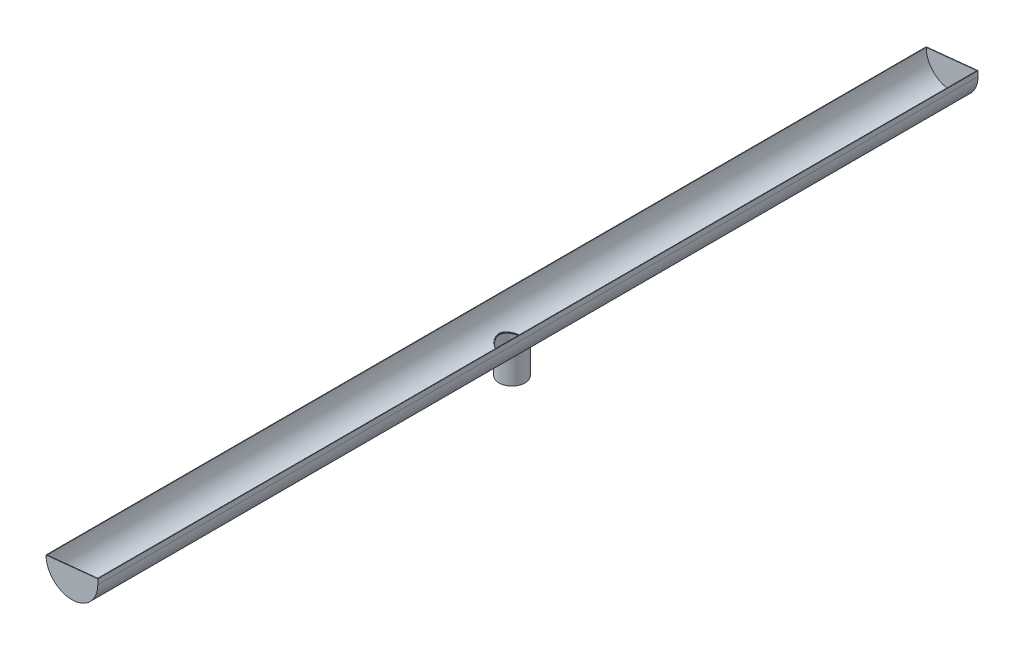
from build123d import *

# Parameters (mm, degrees)
BOSS_EXTRU_1_DEPTH         = 850
BOSS_EXTRU_2_DEPTH         = 1
R_P_TITION_LIN_AIRE1_COUNT = 2
R_P_TITION_LIN_AIRE1_PITCH = 1699
ESQUISSE3_R                = 25
ENL_V_MAT_EXTRU_1_DEPTH    = 853.936105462
BOSS_EXTRU_5_REACH         = 860.545
BOSS_EXTRU_5_END_RADIUS    = 50
ESQUISSE4_R                = 25
ESQUISSE4_R_2              = 24


with BuildPart() as part:
    # Esquisse1 → Boss.-Extru.1 (new, symmetric)
    with BuildSketch(Plane.XY):
        with BuildLine():
            Line((49, 0), (49, 10))
            Line((49, 10), (50, 10))
            Line((50, 10), (50, 0))
            ThreePointArc((50, 0), (0, -50), (-50, 0))
            Line((-50, 0), (-49, 0))
            ThreePointArc((-49, 0), (0, -49), (49, 0))
        make_face()
    extrude(amount=BOSS_EXTRU_1_DEPTH, both=True)

    # Esquisse2 → Boss.-Extru.2 (add)
    with BuildSketch(Plane.XY.offset(850)):
        with BuildLine():
            Line((49, 0), (49, 10))
            Line((49, 10), (-49, 0))
            ThreePointArc((-49, 0), (0, -49), (49, 0))
        make_face()
    boss_extru_2 = extrude(amount=-BOSS_EXTRU_2_DEPTH)

    # R_p_tition lin_aire1: Boss.-Extru.2 ×2
    with Locations(*[(0, 0, -i * R_P_TITION_LIN_AIRE1_PITCH) for i in range(1, R_P_TITION_LIN_AIRE1_COUNT)]):
        add(boss_extru_2)

    # Esquisse3 → Enl_v. mat.-Extru.1 (cut, through all)
    with BuildSketch(Plane(origin=(0, 0, 0), x_dir=(1, 0, 0), z_dir=(0, 1, 0))):
        with Locations(Location((0, 0, 0), (0, 0, 270))):
            Circle(ESQUISSE3_R)
    extrude(amount=-ENL_V_MAT_EXTRU_1_DEPTH, mode=Mode.SUBTRACT)


with BuildPart() as body_2:
    # Boss.-Extru.5: up to this cylinder (the profile starts outside it)
    boss_extru_5_end = Plane(origin=(0, 0, 24.292893), z_dir=(0, 0, -1)) * Cylinder(BOSS_EXTRU_5_END_RADIUS, 1822.09, mode=Mode.PRIVATE)
    # Esquisse4 → Boss.-Extru.5 (new, up to the surface)
    with BuildSketch(Plane(origin=(0, -100, 0), x_dir=(1, 0, 0), z_dir=(0, 1, 0)), mode=Mode.PRIVATE) as boss_extru_5_sk1:
        with Locations(Location((0, 0, 0), (0, 0, 90))):
            Circle(ESQUISSE4_R)
        with Locations(Location((0, 0, 0), (0, 0, 90))):
            Circle(ESQUISSE4_R_2, mode=Mode.SUBTRACT)
    boss_extru_5_tool1 = extrude(boss_extru_5_sk1.sketch, amount=BOSS_EXTRU_5_REACH, mode=Mode.PRIVATE) - boss_extru_5_end
    add(boss_extru_5_tool1.solids().sort_by_distance((0, -100, 24.292893))[0])


solid = Compound([part.part, body_2.part])
